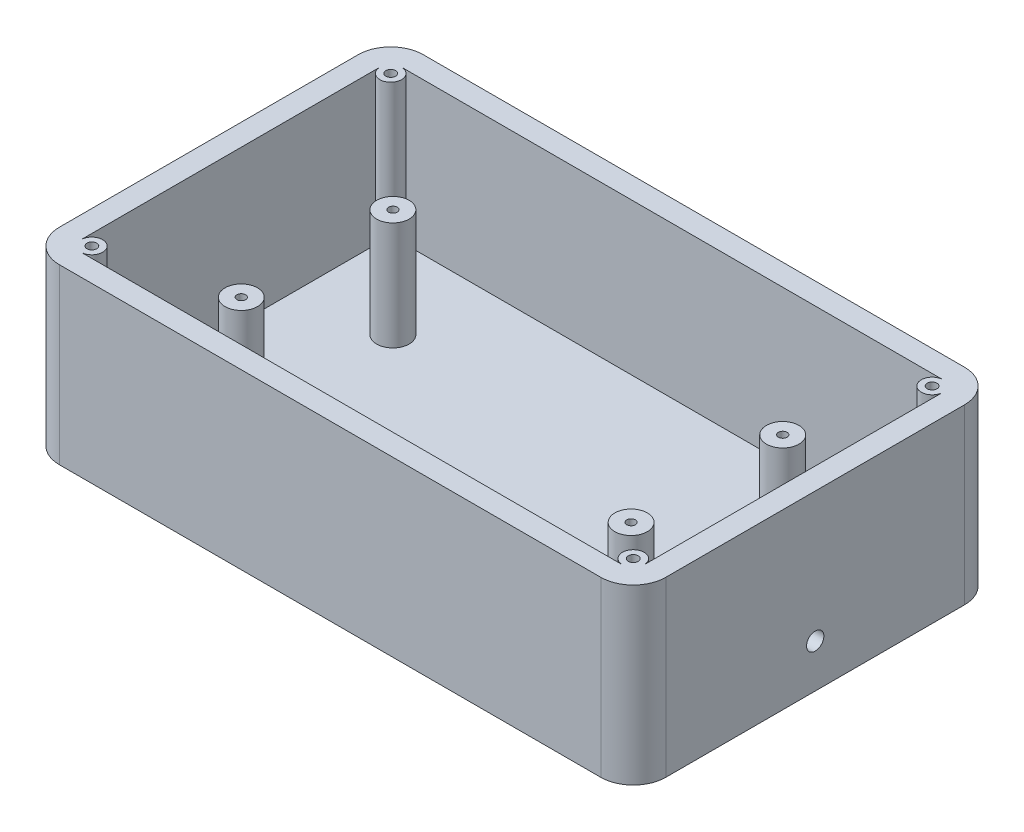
from build123d import *

# Parameters (mm, degrees)
SKETCH1_W                 = 177.8
SKETCH1_H                 = 106.68
BOSS_EXTRUDE1_DEPTH       = 50.8
FILLET1_R                 = 9.525
SHELL2_T                  = -6.35
SKETCH2_R                 = 3.175
BOSS_EXTRUDE2_DEPTH       = 44.45
MIRROR2_COPY_1_SKETCH_R   = 3.175
MIRROR2_COPY_1_DEPTH      = 44.45
F_6_40_TAPPED_HOLE1_D     = 2.8702
F_6_40_TAPPED_HOLE1_DEPTH = 12.7
F_6_40_TAPPED_HOLE1_TIP   = 0.862295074
SKETCH4_R                 = 4.7625
BOSS_EXTRUDE3_DEPTH       = 31.75
F_6_40_TAPPED_HOLE2_D     = 2.54
F_6_40_TAPPED_HOLE2_DEPTH = 8.9154
F_6_40_TAPPED_HOLE2_TIP   = 0.763092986
SKETCH7_R                 = 2.667
CUT_EXTRUDE1_DEPTH        = 12.7
SKETCH8_R                 = 2.54
CUT_EXTRUDE2_DEPTH        = 13.97
F_6_40_TAPPED_HOLE3_D     = 2.54
F_6_40_TAPPED_HOLE3_DEPTH = 8.9154
F_6_40_TAPPED_HOLE3_TIP   = 0.763092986


with BuildPart() as part:
    # Sketch1 → Boss-Extrude1 (new body)
    with BuildSketch(Plane(origin=(0, 0, 0), x_dir=(1, 0, 0), z_dir=(0, 1, 0))):
        Rectangle(SKETCH1_W, SKETCH1_H)
    extrude(amount=-BOSS_EXTRUDE1_DEPTH)

    # Fillet1
    fillet1_edges = [part.edges().sort_by_distance(p)[0] for p in [
        (88.9, -25.4, 53.34),
        (-88.9, -25.4, 53.34),
        (-88.9, -25.4, -53.34),
        (88.9, -25.4, -53.34),
    ]]
    fillet(fillet1_edges, radius=FILLET1_R)

    # Shell2
    shell2_openings = [part.faces().sort_by_distance(p)[0] for p in [
        (0, 0, 0),
    ]]
    offset(amount=SHELL2_T, openings=shell2_openings, kind=Kind.INTERSECTION)

    # Sketch2 → Boss-Extrude2 (add)
    with BuildSketch(Plane(origin=(0, -44.45, 0), x_dir=(1, 0, 0), z_dir=(0, 1, 0))):
        with Locations((-79.375, 43.815)):
            Circle(SKETCH2_R)
    boss_extrude2 = extrude(amount=BOSS_EXTRUDE2_DEPTH)

    # Mirror1: Boss-Extrude2 across plane
    add(boss_extrude2.mirror(Plane(origin=(0, 0, 0), x_dir=(0, 0, 1), z_dir=(1, 0, 0))))

    # Mirror2: Boss-Extrude2 across plane
    add(boss_extrude2.mirror(Plane.XY))

    # Mirror2 copy 1 sketch → Mirror2 copy 1 (add)
    with BuildSketch(Plane(origin=(0, -44.45, 0), x_dir=(-1, 0, 0), z_dir=(0, 1, 0))):
        with Locations((-79.375, 43.815)):
            Circle(MIRROR2_COPY_1_SKETCH_R)
    extrude(amount=MIRROR2_COPY_1_DEPTH)

    # 6-40 Tapped Hole1
    with Locations(Plane(origin=(-79.375, 0, -43.815), x_dir=(0, 0, 1), z_dir=(0, 1, 0))):
        with Locations((0, 0), (87.63, 0), (87.63, 158.75), (0, 158.75)):
            Hole(F_6_40_TAPPED_HOLE1_D / 2, depth=F_6_40_TAPPED_HOLE1_DEPTH)
            with Locations((0, 0, -(F_6_40_TAPPED_HOLE1_DEPTH + F_6_40_TAPPED_HOLE1_TIP / 2))):  # 118° drill point
                Cone(0, F_6_40_TAPPED_HOLE1_D / 2, F_6_40_TAPPED_HOLE1_TIP, mode=Mode.SUBTRACT)

    # Sketch4 → Boss-Extrude3 (add)
    with BuildSketch(Plane(origin=(0, -44.45, 0), x_dir=(1, 0, 0), z_dir=(0, 1, 0))):
        with Locations(Location((-57.15, 22.225, 0), (0, 0, 90))):
            Circle(SKETCH4_R)
        with Locations(Location((57.15, 22.225, 0), (0, 0, 90))):
            Circle(SKETCH4_R)
        with Locations(Location((-57.15, -22.225, 0), (0, 0, 90))):
            Circle(SKETCH4_R)
        with Locations(Location((57.15, -22.225, 0), (0, 0, 90))):
            Circle(SKETCH4_R)
    extrude(amount=BOSS_EXTRUDE3_DEPTH)

    # 6-40 Tapped Hole2
    with Locations(Plane(origin=(-57.15, -12.7, -22.225), x_dir=(0, 0, 1), z_dir=(0, 1, 0))):
        with Locations((0, 0), (0, 114.3), (44.45, 0), (44.45, 114.3)):
            Hole(F_6_40_TAPPED_HOLE2_D / 2, depth=F_6_40_TAPPED_HOLE2_DEPTH)
            with Locations((0, 0, -(F_6_40_TAPPED_HOLE2_DEPTH + F_6_40_TAPPED_HOLE2_TIP / 2))):  # 118° drill point
                Cone(0, F_6_40_TAPPED_HOLE2_D / 2, F_6_40_TAPPED_HOLE2_TIP, mode=Mode.SUBTRACT)

    # Sketch7 → Cut-Extrude1 (cut)
    with BuildSketch(Plane.ZY.offset(88.9)):
        with Locations((0, -38.1)):
            Circle(SKETCH7_R)
    extrude(amount=-CUT_EXTRUDE1_DEPTH, mode=Mode.SUBTRACT)

    # Sketch8 → Cut-Extrude2 (cut)
    with BuildSketch(Plane(origin=(88.9, 0, 0), x_dir=(0, 0, -1), z_dir=(1, 0, 0))):
        with Locations((0, -38.1)):
            Circle(SKETCH8_R)
    extrude(amount=-CUT_EXTRUDE2_DEPTH, mode=Mode.SUBTRACT)

    # 6-40 Tapped Hole3
    with Locations(Plane(origin=(-57.15, -50.8, -22.225), x_dir=(0, 0, -1), z_dir=(0, -1, 0))):
        with Locations((0, 0), (-44.45, 0), (-44.45, 114.3), (0, 114.3)):
            Hole(F_6_40_TAPPED_HOLE3_D / 2, depth=F_6_40_TAPPED_HOLE3_DEPTH)
            with Locations((0, 0, -(F_6_40_TAPPED_HOLE3_DEPTH + F_6_40_TAPPED_HOLE3_TIP / 2))):  # 118° drill point
                Cone(0, F_6_40_TAPPED_HOLE3_D / 2, F_6_40_TAPPED_HOLE3_TIP, mode=Mode.SUBTRACT)


solid = part.part
